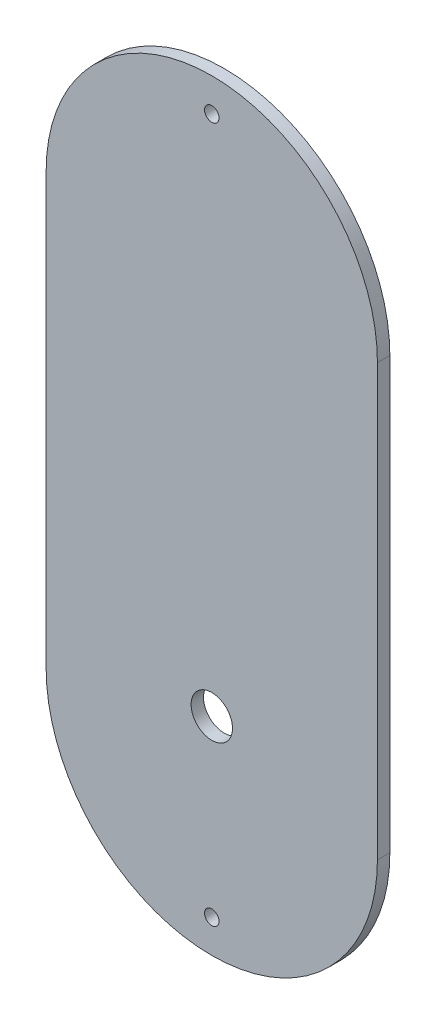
from build123d import *

# Parameters (mm, degrees)
SKETCH1_R      = 1.75
SKETCH1_R_2    = 5
EXTRUDE1_DEPTH = 3


with BuildPart() as part:
    # Sketch1 → Extrude1 (new body)
    with BuildSketch(Plane.XY):
        with BuildLine():
            Line((40, 104), (40, 0))
            ThreePointArc((40, 0), (0, -40), (-40, 0))
            Line((-40, 0), (-40, 104))
            ThreePointArc((-40, 104), (0, 144), (40, 104))
        make_face()
        with Locations((0, -32)):
            Circle(SKETCH1_R, mode=Mode.SUBTRACT)
        with Locations((0, 10)):
            Circle(SKETCH1_R_2, mode=Mode.SUBTRACT)
        with Locations((0, 136)):
            Circle(SKETCH1_R, mode=Mode.SUBTRACT)
    extrude(amount=EXTRUDE1_DEPTH)


solid = part.part
